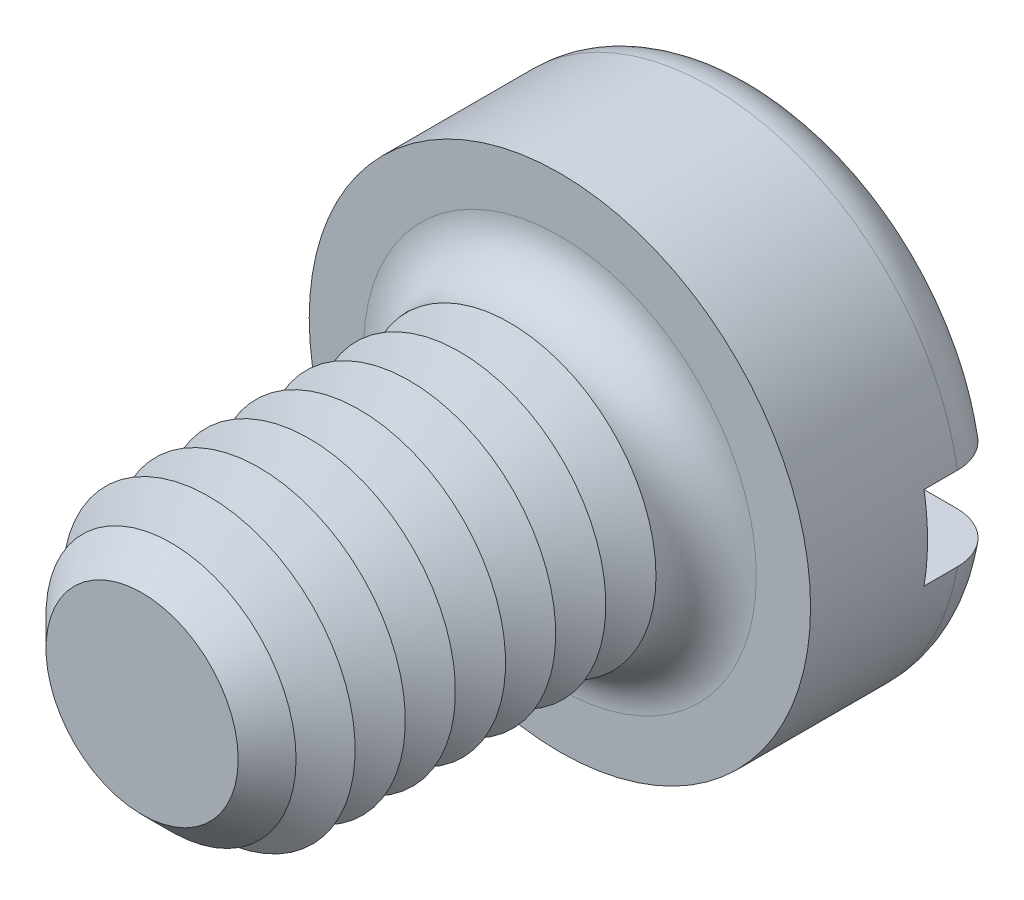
ISO-10303-21;
HEADER;
FILE_DESCRIPTION(('STEP AP214'),'2;1');
FILE_NAME('part.step','',(''),(''),'','','');
FILE_SCHEMA(('AUTOMOTIVE_DESIGN { 1 0 10303 214 1 1 1 1 }'));
ENDSEC;
DATA;
#1=APPLICATION_CONTEXT('core data for automotive mechanical design processes');
#2=APPLICATION_PROTOCOL_DEFINITION('international standard','automotive_design',2000,#1);
#3=PRODUCT_CONTEXT('',#1,'mechanical');
#4=PRODUCT('Part','Part','',(#3));
#5=PRODUCT_RELATED_PRODUCT_CATEGORY('part','',(#4));
#6=PRODUCT_DEFINITION_FORMATION('','',#4);
#7=PRODUCT_DEFINITION_CONTEXT('part definition',#1,'design');
#8=PRODUCT_DEFINITION('design','',#6,#7);
#9=PRODUCT_DEFINITION_SHAPE('','',#8);
#10=(LENGTH_UNIT() NAMED_UNIT(*) SI_UNIT(.MILLI.,.METRE.));
#11=(NAMED_UNIT(*) PLANE_ANGLE_UNIT() SI_UNIT($,.RADIAN.));
#12=(NAMED_UNIT(*) SI_UNIT($,.STERADIAN.) SOLID_ANGLE_UNIT());
#13=UNCERTAINTY_MEASURE_WITH_UNIT(LENGTH_MEASURE(1.E-05),#10,'distance_accuracy_value','');
#14=(GEOMETRIC_REPRESENTATION_CONTEXT(3) GLOBAL_UNCERTAINTY_ASSIGNED_CONTEXT((#13)) GLOBAL_UNIT_ASSIGNED_CONTEXT((#10,
#11,#12)) REPRESENTATION_CONTEXT('',''));
#15=CARTESIAN_POINT('',(0.,0.,0.));
#16=DIRECTION('',(0.,0.,1.));
#17=DIRECTION('',(1.,0.,0.));
#18=AXIS2_PLACEMENT_3D('',#15,#16,#17);
#19=CARTESIAN_POINT('',(0.,0.,-2.4));
#20=DIRECTION('',(0.,0.,1.));
#21=DIRECTION('',(1.,0.,0.));
#22=AXIS2_PLACEMENT_3D('',#19,#20,#21);
#23=PLANE('',#22);
#24=CARTESIAN_POINT('',(0.,0.,-2.4));
#25=DIRECTION('',(0.,0.,1.));
#26=DIRECTION('',(1.,0.,0.));
#27=AXIS2_PLACEMENT_3D('',#24,#25,#26);
#28=CIRCLE('',#27,2.4);
#29=CARTESIAN_POINT('',(-2.3473389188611,0.5,-2.4));
#30=VERTEX_POINT('',#29);
#31=CARTESIAN_POINT('',(2.3473389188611,0.5,-2.4));
#32=VERTEX_POINT('',#31);
#33=EDGE_CURVE('E116',#30,#32,#28,.F.);
#34=ORIENTED_EDGE('',*,*,#33,.T.);
#35=DIRECTION('',(1.,0.,0.));
#36=VECTOR('',#35,1.);
#37=CARTESIAN_POINT('',(-3.,0.5,-2.4));
#38=LINE('',#37,#36);
#39=EDGE_CURVE('E111',#30,#32,#38,.T.);
#40=ORIENTED_EDGE('',*,*,#39,.F.);
#41=EDGE_LOOP('',(#34,#40));
#42=FACE_BOUND('',#41,.T.);
#43=ADVANCED_FACE('F39',(#42),#23,.F.);
#44=CARTESIAN_POINT('',(0.,0.,-1.8));
#45=DIRECTION('',(0.,0.,1.));
#46=DIRECTION('',(1.,0.,0.));
#47=AXIS2_PLACEMENT_3D('',#44,#45,#46);
#48=TOROIDAL_SURFACE('',#47,2.4,0.6);
#49=CARTESIAN_POINT('',(-2.85761641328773,0.5,-2.13010535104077));
#50=CARTESIAN_POINT('',(-2.83871556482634,0.5,-2.1583605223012));
#51=CARTESIAN_POINT('',(-2.81738546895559,0.5,-2.18502342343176));
#52=CARTESIAN_POINT('',(-2.7705148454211,0.5,-2.23439244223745));
#53=CARTESIAN_POINT('',(-2.74496859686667,0.5,-2.25709309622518));
#54=CARTESIAN_POINT('',(-2.6904684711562,0.5,-2.29787524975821));
#55=CARTESIAN_POINT('',(-2.66151863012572,0.5,-2.3159621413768));
#56=CARTESIAN_POINT('',(-2.60103287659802,0.5,-2.34708203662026));
#57=CARTESIAN_POINT('',(-2.56949759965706,0.5,-2.36011627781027));
#58=CARTESIAN_POINT('',(-2.50430694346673,0.5,-2.38095952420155));
#59=CARTESIAN_POINT('',(-2.47062984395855,0.5,-2.38870056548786));
#60=CARTESIAN_POINT('',(-2.40245905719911,0.5,-2.39852415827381));
#61=CARTESIAN_POINT('',(-2.36796525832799,0.5,-2.40060593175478));
#62=CARTESIAN_POINT('',(-2.29850850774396,0.5,-2.39907718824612));
#63=CARTESIAN_POINT('',(-2.2635477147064,0.5,-2.3953679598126));
#64=CARTESIAN_POINT('',(-2.19472542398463,0.5,-2.38219781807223));
#65=CARTESIAN_POINT('',(-2.16086402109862,0.5,-2.37273641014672));
#66=CARTESIAN_POINT('',(-2.09483473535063,0.5,-2.3481926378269));
#67=CARTESIAN_POINT('',(-2.06268841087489,0.5,-2.3330521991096));
#68=CARTESIAN_POINT('',(-2.00140871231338,0.5,-2.29756210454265));
#69=CARTESIAN_POINT('',(-1.97227539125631,0.5,-2.27721235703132));
#70=CARTESIAN_POINT('',(-1.91805676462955,0.5,-2.23196210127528));
#71=CARTESIAN_POINT('',(-1.89294995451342,0.5,-2.20708739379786));
#72=CARTESIAN_POINT('',(-1.84740424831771,0.5,-2.1533758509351));
#73=CARTESIAN_POINT('',(-1.82696468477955,0.5,-2.12453958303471));
#74=CARTESIAN_POINT('',(-1.7919439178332,0.5,-2.06452274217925));
#75=CARTESIAN_POINT('',(-1.7772221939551,0.5,-2.03342424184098));
#76=CARTESIAN_POINT('',(-1.75343025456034,0.5,-1.96913621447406));
#77=CARTESIAN_POINT('',(-1.74435859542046,0.5,-1.93594722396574));
#78=CARTESIAN_POINT('',(-1.73243855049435,0.5,-1.86969199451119));
#79=CARTESIAN_POINT('',(-1.72938008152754,0.5,-1.83666346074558));
#80=CARTESIAN_POINT('',(-1.72896592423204,0.5,-1.77057287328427));
#81=CARTESIAN_POINT('',(-1.73160950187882,0.5,-1.73751082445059));
#82=CARTESIAN_POINT('',(-1.7423966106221,0.5,-1.67291835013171));
#83=CARTESIAN_POINT('',(-1.75043952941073,0.5,-1.64137102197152));
#84=CARTESIAN_POINT('',(-1.77163396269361,0.5,-1.58004446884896));
#85=CARTESIAN_POINT('',(-1.78478577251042,0.5,-1.55026534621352));
#86=CARTESIAN_POINT('',(-1.81598186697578,0.5,-1.49283859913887));
#87=CARTESIAN_POINT('',(-1.83409369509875,0.5,-1.46522772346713));
#88=CARTESIAN_POINT('',(-1.87455179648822,0.5,-1.41330756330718));
#89=CARTESIAN_POINT('',(-1.89689874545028,0.5,-1.38899880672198));
#90=CARTESIAN_POINT('',(-1.94600584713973,0.5,-1.34349499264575));
#91=CARTESIAN_POINT('',(-1.97289034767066,0.5,-1.32243411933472));
#92=CARTESIAN_POINT('',(-2.02972905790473,0.5,-1.28496935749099));
#93=CARTESIAN_POINT('',(-2.05968375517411,0.5,-1.26856621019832));
#94=CARTESIAN_POINT('',(-2.12276894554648,0.5,-1.24040709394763));
#95=CARTESIAN_POINT('',(-2.15596700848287,0.5,-1.22880230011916));
#96=CARTESIAN_POINT('',(-2.22383000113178,0.5,-1.21126311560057));
#97=CARTESIAN_POINT('',(-2.25849504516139,0.5,-1.20532916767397));
#98=CARTESIAN_POINT('',(-2.32870403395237,0.5,-1.1992792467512));
#99=CARTESIAN_POINT('',(-2.36425340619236,0.5,-1.19922586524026));
#100=CARTESIAN_POINT('',(-2.4348506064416,0.5,-1.2051326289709));
#101=CARTESIAN_POINT('',(-2.4698984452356,0.5,-1.21109264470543));
#102=CARTESIAN_POINT('',(-2.53821803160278,0.5,-1.22883658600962));
#103=CARTESIAN_POINT('',(-2.57150081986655,0.5,-1.24057794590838));
#104=CARTESIAN_POINT('',(-2.63557260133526,0.5,-1.2695744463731));
#105=CARTESIAN_POINT('',(-2.66636179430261,0.5,-1.28682914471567));
#106=CARTESIAN_POINT('',(-2.72402406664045,0.5,-1.32606063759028));
#107=CARTESIAN_POINT('',(-2.75095352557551,0.5,-1.34795455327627));
#108=CARTESIAN_POINT('',(-2.80067182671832,0.5,-1.39602603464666));
#109=CARTESIAN_POINT('',(-2.82346106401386,0.5,-1.42220319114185));
#110=CARTESIAN_POINT('',(-2.86383281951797,0.5,-1.47760238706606));
#111=CARTESIAN_POINT('',(-2.88149947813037,0.5,-1.50676312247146));
#112=CARTESIAN_POINT('',(-2.91160874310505,0.5,-1.56766595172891));
#113=CARTESIAN_POINT('',(-2.92405198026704,0.5,-1.59940773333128));
#114=CARTESIAN_POINT('',(-2.94319943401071,0.5,-1.66411282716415));
#115=CARTESIAN_POINT('',(-2.94997843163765,0.5,-1.69705402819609));
#116=CARTESIAN_POINT('',(-2.95787009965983,0.5,-1.7636173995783));
#117=CARTESIAN_POINT('',(-2.95898157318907,0.5,-1.79723971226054));
#118=CARTESIAN_POINT('',(-2.95551354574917,0.5,-1.86397776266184));
#119=CARTESIAN_POINT('',(-2.95096897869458,0.5,-1.89709534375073));
#120=CARTESIAN_POINT('',(-2.93638731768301,0.5,-1.96206785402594));
#121=CARTESIAN_POINT('',(-2.92635713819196,0.5,-1.99392431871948));
#122=CARTESIAN_POINT('',(-2.90618743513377,0.5,-2.04315073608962));
#123=CARTESIAN_POINT('',(-2.89769874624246,0.5,-2.06121519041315));
#124=CARTESIAN_POINT('',(-2.87895753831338,0.5,-2.096404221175));
#125=CARTESIAN_POINT('',(-2.86870503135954,0.5,-2.11352880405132));
#126=CARTESIAN_POINT('',(-2.85761641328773,0.5,-2.13010535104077));
#127=B_SPLINE_CURVE_WITH_KNOTS('',3,(#49,#50,#51,#52,#53,#54,#55,#56,#57,#58,#59,#60,#61,#62,
#63,#64,#65,#66,#67,#68,#69,#70,#71,#72,#73,#74,#75,#76,#77,#78,#79,#80,#81,#82,#83,#84,#85,#86,
#87,#88,#89,#90,#91,#92,#93,#94,#95,#96,#97,#98,#99,#100,#101,#102,#103,#104,#105,#106,#107,
#108,#109,#110,#111,#112,#113,#114,#115,#116,#117,#118,#119,#120,#121,#122,#123,#124,#125,#126),
.UNSPECIFIED.,.T.,.F.,(4,2,2,2,2,2,2,2,2,2,2,2,2,2,2,2,2,2,2,2,2,2,2,2,2,2,2,2,2,2,2,2,2,2,2,2,
2,2,4),(0.,0.101907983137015,0.203955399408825,0.305883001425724,0.407785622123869,
0.510973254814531,0.614175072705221,0.719155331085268,0.824144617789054,0.930238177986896,
1.03633360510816,1.14184204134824,1.24733537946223,1.35004136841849,1.45272110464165,
1.5517448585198,1.65075586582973,1.74797128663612,1.84519232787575,1.9438094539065,
2.0424423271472,2.14443321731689,2.24644032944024,2.35145317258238,2.45647421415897,
2.56261297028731,2.66874944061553,2.77411589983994,2.87947390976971,2.98308820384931,
3.08669260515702,3.18848388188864,3.29026286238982,3.39067588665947,3.49111011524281,
3.59092708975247,3.69061853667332,3.75040561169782,3.81019227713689),.UNSPECIFIED.);
#128=CARTESIAN_POINT('',(-2.95803989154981,0.5,-1.8));
#129=VERTEX_POINT('',#128);
#130=EDGE_CURVE('E241',#129,#30,#127,.T.);
#131=ORIENTED_EDGE('',*,*,#130,.F.);
#132=CARTESIAN_POINT('',(0.,0.,-1.8));
#133=DIRECTION('',(0.,0.,1.));
#134=DIRECTION('',(1.,0.,0.));
#135=AXIS2_PLACEMENT_3D('',#132,#133,#134);
#136=CIRCLE('',#135,3.);
#137=CARTESIAN_POINT('',(2.95803989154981,0.5,-1.8));
#138=VERTEX_POINT('',#137);
#139=EDGE_CURVE('E125',#138,#129,#136,.T.);
#140=ORIENTED_EDGE('',*,*,#139,.F.);
#141=CARTESIAN_POINT('',(1.78664846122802,0.5,-2.05158390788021));
#142=CARTESIAN_POINT('',(1.80142751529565,0.5,-2.08239430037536));
#143=CARTESIAN_POINT('',(1.81889355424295,0.5,-2.111949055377));
#144=CARTESIAN_POINT('',(1.8585933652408,0.5,-2.16770384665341));
#145=CARTESIAN_POINT('',(1.88083491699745,0.5,-2.19389829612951));
#146=CARTESIAN_POINT('',(1.92931942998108,0.5,-2.24217519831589));
#147=CARTESIAN_POINT('',(1.95555471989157,0.5,-2.26426535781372));
#148=CARTESIAN_POINT('',(2.01127789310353,0.5,-2.30384045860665));
#149=CARTESIAN_POINT('',(2.04076488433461,0.5,-2.32132665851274));
#150=CARTESIAN_POINT('',(2.10290022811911,0.5,-2.3516259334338));
#151=CARTESIAN_POINT('',(2.13560600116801,0.5,-2.3643213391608));
#152=CARTESIAN_POINT('',(2.20267136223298,0.5,-2.38412242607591));
#153=CARTESIAN_POINT('',(2.23703118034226,0.5,-2.3912273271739));
#154=CARTESIAN_POINT('',(2.30690186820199,0.5,-2.39969404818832));
#155=CARTESIAN_POINT('',(2.34242185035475,0.5,-2.40098100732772));
#156=CARTESIAN_POINT('',(2.41317063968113,0.5,-2.39753827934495));
#157=CARTESIAN_POINT('',(2.44839945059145,0.5,-2.39280866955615));
#158=CARTESIAN_POINT('',(2.51734146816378,0.5,-2.37746773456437));
#159=CARTESIAN_POINT('',(2.55106223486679,0.5,-2.3668904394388));
#160=CARTESIAN_POINT('',(2.61620389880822,0.5,-2.34013333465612));
#161=CARTESIAN_POINT('',(2.64762498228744,0.5,-2.32395397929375));
#162=CARTESIAN_POINT('',(2.70673284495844,0.5,-2.28672393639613));
#163=CARTESIAN_POINT('',(2.73447138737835,0.5,-2.26575544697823));
#164=CARTESIAN_POINT('',(2.78595339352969,0.5,-2.21938197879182));
#165=CARTESIAN_POINT('',(2.80969724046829,0.5,-2.19397742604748));
#166=CARTESIAN_POINT('',(2.85207235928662,0.5,-2.13993965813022));
#167=CARTESIAN_POINT('',(2.87078674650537,0.5,-2.11137160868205));
#168=CARTESIAN_POINT('',(2.90307455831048,0.5,-2.05146448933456));
#169=CARTESIAN_POINT('',(2.91664841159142,0.5,-2.02012565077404));
#170=CARTESIAN_POINT('',(2.93808283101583,0.5,-1.95603682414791));
#171=CARTESIAN_POINT('',(2.94602016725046,0.5,-1.92331249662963));
#172=CARTESIAN_POINT('',(2.95624273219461,0.5,-1.85699296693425));
#173=CARTESIAN_POINT('',(2.95852824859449,0.5,-1.82339780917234));
#174=CARTESIAN_POINT('',(2.95738171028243,0.5,-1.75655451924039));
#175=CARTESIAN_POINT('',(2.95399174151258,0.5,-1.72330565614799));
#176=CARTESIAN_POINT('',(2.94167749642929,0.5,-1.65784996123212));
#177=CARTESIAN_POINT('',(2.93275329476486,0.5,-1.62564311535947));
#178=CARTESIAN_POINT('',(2.90963870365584,0.5,-1.56317641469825));
#179=CARTESIAN_POINT('',(2.89544787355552,0.5,-1.53291672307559));
#180=CARTESIAN_POINT('',(2.86222325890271,0.5,-1.47518589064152));
#181=CARTESIAN_POINT('',(2.84318935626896,0.5,-1.44771481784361));
#182=CARTESIAN_POINT('',(2.80067851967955,0.5,-1.39611362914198));
#183=CARTESIAN_POINT('',(2.77716960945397,0.5,-1.37200986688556));
#184=CARTESIAN_POINT('',(2.72648704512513,0.5,-1.3280274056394));
#185=CARTESIAN_POINT('',(2.69931317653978,0.5,-1.3081489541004));
#186=CARTESIAN_POINT('',(2.64167967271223,0.5,-1.27288334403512));
#187=CARTESIAN_POINT('',(2.61118015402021,0.5,-1.25756138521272));
#188=CARTESIAN_POINT('',(2.54807315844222,0.5,-1.2321564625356));
#189=CARTESIAN_POINT('',(2.51546550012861,0.5,-1.22207395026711));
#190=CARTESIAN_POINT('',(2.44846246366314,0.5,-1.20724783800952));
#191=CARTESIAN_POINT('',(2.41404584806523,0.5,-1.2026002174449));
#192=CARTESIAN_POINT('',(2.34491756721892,0.5,-1.19904907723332));
#193=CARTESIAN_POINT('',(2.3102058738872,0.5,-1.20014611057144));
#194=CARTESIAN_POINT('',(2.24087507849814,0.5,-1.20808958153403));
#195=CARTESIAN_POINT('',(2.20626660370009,0.5,-1.21502895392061));
#196=CARTESIAN_POINT('',(2.13868705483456,0.5,-1.23457616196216));
#197=CARTESIAN_POINT('',(2.10571611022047,0.5,-1.24718444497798));
#198=CARTESIAN_POINT('',(2.04212010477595,0.5,-1.2778419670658));
#199=CARTESIAN_POINT('',(2.0115131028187,0.5,-1.29592871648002));
#200=CARTESIAN_POINT('',(1.95381117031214,0.5,-1.33703838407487));
#201=CARTESIAN_POINT('',(1.92671618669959,0.5,-1.36006122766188));
#202=CARTESIAN_POINT('',(1.8771749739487,0.5,-1.41014760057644));
#203=CARTESIAN_POINT('',(1.85467966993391,0.5,-1.43716252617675));
#204=CARTESIAN_POINT('',(1.8147167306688,0.5,-1.49468601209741));
#205=CARTESIAN_POINT('',(1.79724791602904,0.5,-1.52519375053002));
#206=CARTESIAN_POINT('',(1.76843420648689,0.5,-1.58782676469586));
#207=CARTESIAN_POINT('',(1.75691546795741,0.5,-1.61987202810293));
#208=CARTESIAN_POINT('',(1.73963101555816,0.5,-1.68548715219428));
#209=CARTESIAN_POINT('',(1.73386545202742,0.5,-1.71905705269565));
#210=CARTESIAN_POINT('',(1.72840927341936,0.5,-1.78556262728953));
#211=CARTESIAN_POINT('',(1.72852416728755,0.5,-1.8184825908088));
#212=CARTESIAN_POINT('',(1.73434422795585,0.5,-1.88379362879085));
#213=CARTESIAN_POINT('',(1.74004181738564,0.5,-1.91618535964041));
#214=CARTESIAN_POINT('',(1.75312909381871,0.5,-1.96568884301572));
#215=CARTESIAN_POINT('',(1.75869685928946,0.5,-1.98330302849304));
#216=CARTESIAN_POINT('',(1.77146455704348,0.5,-2.01792824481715));
#217=CARTESIAN_POINT('',(1.7786644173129,0.5,-2.03493930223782));
#218=CARTESIAN_POINT('',(1.78664846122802,0.5,-2.05158390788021));
#219=B_SPLINE_CURVE_WITH_KNOTS('',3,(#141,#142,#143,#144,#145,#146,#147,#148,#149,#150,#151,
#152,#153,#154,#155,#156,#157,#158,#159,#160,#161,#162,#163,#164,#165,#166,#167,#168,#169,#170,
#171,#172,#173,#174,#175,#176,#177,#178,#179,#180,#181,#182,#183,#184,#185,#186,#187,#188,#189,
#190,#191,#192,#193,#194,#195,#196,#197,#198,#199,#200,#201,#202,#203,#204,#205,#206,#207,#208,
#209,#210,#211,#212,#213,#214,#215,#216,#217,#218),.UNSPECIFIED.,.T.,.F.,(4,2,2,2,2,2,2,2,2,2,2,
2,2,2,2,2,2,2,2,2,2,2,2,2,2,2,2,2,2,2,2,2,2,2,2,2,2,2,4),(0.,0.10244464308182,0.205057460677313,
0.307475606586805,0.409865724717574,0.514628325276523,0.619405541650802,0.72552718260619,
0.831647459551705,0.937156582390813,1.04265715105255,1.1464674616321,1.25026780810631,
1.3522293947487,1.45418247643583,1.55471883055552,1.6552500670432,1.75503912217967,
1.8548268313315,1.95462289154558,2.05442138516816,2.15496174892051,2.25550799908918,
2.35743049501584,2.45936177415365,2.56306719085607,2.66678259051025,2.77217967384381,
2.87758507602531,2.98372914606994,3.08987161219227,3.19481457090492,3.29973288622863,
3.40138228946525,3.50303434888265,3.60132659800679,3.69948562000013,3.75483142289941,
3.8101747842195),.UNSPECIFIED.);
#220=EDGE_CURVE('E243',#32,#138,#219,.T.);
#221=ORIENTED_EDGE('',*,*,#220,.F.);
#222=ORIENTED_EDGE('',*,*,#33,.F.);
#223=EDGE_LOOP('',(#131,#140,#221,#222));
#224=FACE_BOUND('',#223,.T.);
#225=ADVANCED_FACE('F225',(#224),#48,.T.);
#226=CARTESIAN_POINT('',(0.,0.,-2.4));
#227=DIRECTION('',(0.,0.,1.));
#228=DIRECTION('',(1.,0.,0.));
#229=AXIS2_PLACEMENT_3D('',#226,#227,#228);
#230=CYLINDRICAL_SURFACE('',#229,3.);
#231=DIRECTION('',(0.,0.,1.));
#232=VECTOR('',#231,1.);
#233=CARTESIAN_POINT('',(2.95803989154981,0.5,-2.4));
#234=LINE('',#233,#232);
#235=CARTESIAN_POINT('',(2.95803989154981,0.5,-1.4));
#236=VERTEX_POINT('',#235);
#237=EDGE_CURVE('E257',#138,#236,#234,.T.);
#238=ORIENTED_EDGE('',*,*,#237,.F.);
#239=ORIENTED_EDGE('',*,*,#139,.T.);
#240=DIRECTION('',(0.,0.,1.));
#241=VECTOR('',#240,1.);
#242=CARTESIAN_POINT('',(-2.95803989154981,0.5,-2.4));
#243=LINE('',#242,#241);
#244=CARTESIAN_POINT('',(-2.95803989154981,0.5,-1.4));
#245=VERTEX_POINT('',#244);
#246=EDGE_CURVE('E63',#245,#129,#243,.F.);
#247=ORIENTED_EDGE('',*,*,#246,.F.);
#248=CARTESIAN_POINT('',(0.,0.,-1.4));
#249=DIRECTION('',(0.,0.,-1.));
#250=DIRECTION('',(-1.,0.,0.));
#251=AXIS2_PLACEMENT_3D('',#248,#249,#250);
#252=CIRCLE('',#251,3.);
#253=CARTESIAN_POINT('',(-2.95803989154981,-0.5,-1.4));
#254=VERTEX_POINT('',#253);
#255=EDGE_CURVE('E43',#245,#254,#252,.F.);
#256=ORIENTED_EDGE('',*,*,#255,.T.);
#257=DIRECTION('',(0.,0.,1.));
#258=VECTOR('',#257,1.);
#259=CARTESIAN_POINT('',(-2.95803989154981,-0.5,-2.4));
#260=LINE('',#259,#258);
#261=CARTESIAN_POINT('',(-2.9580398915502,-0.5,-1.79999999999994));
#262=VERTEX_POINT('',#261);
#263=EDGE_CURVE('E255',#262,#254,#260,.T.);
#264=ORIENTED_EDGE('',*,*,#263,.F.);
#265=CARTESIAN_POINT('',(2.95803989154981,-0.5,-1.8));
#266=VERTEX_POINT('',#265);
#267=EDGE_CURVE('E127',#262,#266,#136,.T.);
#268=ORIENTED_EDGE('',*,*,#267,.T.);
#269=DIRECTION('',(0.,0.,1.));
#270=VECTOR('',#269,1.);
#271=CARTESIAN_POINT('',(2.95803989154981,-0.5,-2.4));
#272=LINE('',#271,#270);
#273=CARTESIAN_POINT('',(2.95803989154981,-0.5,-1.4));
#274=VERTEX_POINT('',#273);
#275=EDGE_CURVE('E55',#274,#266,#272,.F.);
#276=ORIENTED_EDGE('',*,*,#275,.F.);
#277=EDGE_CURVE('E11',#274,#236,#252,.F.);
#278=ORIENTED_EDGE('',*,*,#277,.T.);
#279=EDGE_LOOP('',(#238,#239,#247,#256,#264,#268,#276,#278));
#280=FACE_BOUND('',#279,.T.);
#281=CARTESIAN_POINT('',(0.,0.,0.));
#282=DIRECTION('',(0.,0.,1.));
#283=DIRECTION('',(1.,0.,0.));
#284=AXIS2_PLACEMENT_3D('',#281,#282,#283);
#285=CIRCLE('',#284,3.);
#286=CARTESIAN_POINT('',(3.,0.,0.));
#287=VERTEX_POINT('',#286);
#288=EDGE_CURVE('E260',#287,#287,#285,.T.);
#289=ORIENTED_EDGE('',*,*,#288,.F.);
#290=EDGE_LOOP('',(#289));
#291=FACE_BOUND('',#290,.T.);
#292=ADVANCED_FACE('F221',(#280,#291),#230,.T.);
#293=CARTESIAN_POINT('',(2.3473389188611,-0.5,-2.4));
#294=VERTEX_POINT('',#293);
#295=CARTESIAN_POINT('',(-2.3473389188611,-0.5,-2.4));
#296=VERTEX_POINT('',#295);
#297=EDGE_CURVE('E109',#294,#296,#28,.F.);
#298=ORIENTED_EDGE('',*,*,#297,.T.);
#299=DIRECTION('',(-1.,0.,0.));
#300=VECTOR('',#299,1.);
#301=CARTESIAN_POINT('',(-3.,-0.5,-2.4));
#302=LINE('',#301,#300);
#303=EDGE_CURVE('E96',#294,#296,#302,.T.);
#304=ORIENTED_EDGE('',*,*,#303,.F.);
#305=EDGE_LOOP('',(#298,#304));
#306=FACE_BOUND('',#305,.T.);
#307=ADVANCED_FACE('F108',(#306),#23,.F.);
#308=CARTESIAN_POINT('',(0.,0.,0.));
#309=DIRECTION('',(0.,0.,1.));
#310=DIRECTION('',(1.,0.,0.));
#311=AXIS2_PLACEMENT_3D('',#308,#309,#310);
#312=PLANE('',#311);
#313=CARTESIAN_POINT('',(0.,0.,0.));
#314=DIRECTION('',(0.,0.,1.));
#315=DIRECTION('',(1.,0.,0.));
#316=AXIS2_PLACEMENT_3D('',#313,#314,#315);
#317=CIRCLE('',#316,2.35);
#318=CARTESIAN_POINT('',(2.35,0.,0.));
#319=VERTEX_POINT('',#318);
#320=EDGE_CURVE('E115',#319,#319,#317,.F.);
#321=ORIENTED_EDGE('',*,*,#320,.T.);
#322=EDGE_LOOP('',(#321));
#323=FACE_BOUND('',#322,.T.);
#324=ORIENTED_EDGE('',*,*,#288,.T.);
#325=EDGE_LOOP('',(#324));
#326=FACE_BOUND('',#325,.T.);
#327=ADVANCED_FACE('F220',(#323,#326),#312,.T.);
#328=CARTESIAN_POINT('',(-2.85761641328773,-0.5,-2.13010535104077));
#329=CARTESIAN_POINT('',(-2.87617085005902,-0.5,-2.10236255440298));
#330=CARTESIAN_POINT('',(-2.89241094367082,-0.5,-2.07304478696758));
#331=CARTESIAN_POINT('',(-2.91975805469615,-0.5,-2.01207835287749));
#332=CARTESIAN_POINT('',(-2.93085958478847,-0.5,-1.98042723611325));
#333=CARTESIAN_POINT('',(-2.94757590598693,-0.5,-1.91570997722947));
#334=CARTESIAN_POINT('',(-2.95319165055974,-0.5,-1.88264408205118));
#335=CARTESIAN_POINT('',(-2.95876526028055,-0.5,-1.81604673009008));
#336=CARTESIAN_POINT('',(-2.95872441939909,-0.5,-1.78251538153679));
#337=CARTESIAN_POINT('',(-2.95300126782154,-0.5,-1.71606888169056));
#338=CARTESIAN_POINT('',(-2.94734076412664,-0.5,-1.68315184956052));
#339=CARTESIAN_POINT('',(-2.93058183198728,-0.5,-1.61873244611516));
#340=CARTESIAN_POINT('',(-2.91948325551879,-0.5,-1.58723011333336));
#341=CARTESIAN_POINT('',(-2.89215903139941,-0.5,-1.52647404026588));
#342=CARTESIAN_POINT('',(-2.87592518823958,-0.5,-1.49722398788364));
#343=CARTESIAN_POINT('',(-2.83881787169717,-0.5,-1.44183365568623));
#344=CARTESIAN_POINT('',(-2.81794425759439,-0.5,-1.41569347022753));
#345=CARTESIAN_POINT('',(-2.77196258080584,-0.5,-1.36700890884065));
#346=CARTESIAN_POINT('',(-2.74681874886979,-0.5,-1.34449832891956));
#347=CARTESIAN_POINT('',(-2.69315595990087,-0.5,-1.30394571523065));
#348=CARTESIAN_POINT('',(-2.66463678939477,-0.5,-1.28590396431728));
#349=CARTESIAN_POINT('',(-2.6045885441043,-0.5,-1.25451133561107));
#350=CARTESIAN_POINT('',(-2.573021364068,-0.5,-1.24123336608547));
#351=CARTESIAN_POINT('',(-2.50813094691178,-0.5,-1.22006271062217));
#352=CARTESIAN_POINT('',(-2.47480755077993,-0.5,-1.21217051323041));
#353=CARTESIAN_POINT('',(-2.40672281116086,-0.5,-1.20185046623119));
#354=CARTESIAN_POINT('',(-2.37194646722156,-0.5,-1.19952155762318));
#355=CARTESIAN_POINT('',(-2.30248663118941,-0.5,-1.20064178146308));
#356=CARTESIAN_POINT('',(-2.26780314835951,-0.5,-1.20409147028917));
#357=CARTESIAN_POINT('',(-2.19896003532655,-0.5,-1.21674803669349));
#358=CARTESIAN_POINT('',(-2.16481620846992,-0.5,-1.22604100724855));
#359=CARTESIAN_POINT('',(-2.09855902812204,-0.5,-1.25020237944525));
#360=CARTESIAN_POINT('',(-2.0664458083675,-0.5,-1.2650711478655));
#361=CARTESIAN_POINT('',(-2.00504979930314,-0.5,-1.3000633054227));
#362=CARTESIAN_POINT('',(-1.97577870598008,-0.5,-1.32020724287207));
#363=CARTESIAN_POINT('',(-1.92109882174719,-0.5,-1.36519538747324));
#364=CARTESIAN_POINT('',(-1.89568984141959,-0.5,-1.39003936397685));
#365=CARTESIAN_POINT('',(-1.84992350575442,-0.5,-1.44333696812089));
#366=CARTESIAN_POINT('',(-1.82949305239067,-0.5,-1.47172774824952));
#367=CARTESIAN_POINT('',(-1.79388305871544,-0.5,-1.53163225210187));
#368=CARTESIAN_POINT('',(-1.77870235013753,-0.5,-1.56314527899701));
#369=CARTESIAN_POINT('',(-1.7545759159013,-0.5,-1.62726698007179));
#370=CARTESIAN_POINT('',(-1.74543784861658,-0.5,-1.65980327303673));
#371=CARTESIAN_POINT('',(-1.73294830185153,-0.5,-1.72596654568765));
#372=CARTESIAN_POINT('',(-1.72959555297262,-0.5,-1.7595932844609));
#373=CARTESIAN_POINT('',(-1.72881879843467,-0.5,-1.82588200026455));
#374=CARTESIAN_POINT('',(-1.73121660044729,-0.5,-1.85854202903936));
#375=CARTESIAN_POINT('',(-1.74148022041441,-0.5,-1.9229888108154));
#376=CARTESIAN_POINT('',(-1.74934586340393,-0.5,-1.95477559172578));
#377=CARTESIAN_POINT('',(-1.77023164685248,-0.5,-2.01650910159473));
#378=CARTESIAN_POINT('',(-1.78323812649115,-0.5,-2.04646046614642));
#379=CARTESIAN_POINT('',(-1.81396733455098,-0.5,-2.10383471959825));
#380=CARTESIAN_POINT('',(-1.83169061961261,-0.5,-2.13125730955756));
#381=CARTESIAN_POINT('',(-1.87183626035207,-0.5,-2.18359240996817));
#382=CARTESIAN_POINT('',(-1.89437158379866,-0.5,-2.20841820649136));
#383=CARTESIAN_POINT('',(-1.9431646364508,-0.5,-2.25409214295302));
#384=CARTESIAN_POINT('',(-1.96942301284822,-0.5,-2.27493958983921));
#385=CARTESIAN_POINT('',(-2.025898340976,-0.5,-2.31281042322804));
#386=CARTESIAN_POINT('',(-2.05622082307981,-0.5,-2.32967654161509));
#387=CARTESIAN_POINT('',(-2.11922391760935,-0.5,-2.35820255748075));
#388=CARTESIAN_POINT('',(-2.15190483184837,-0.5,-2.3698617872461));
#389=CARTESIAN_POINT('',(-2.21944675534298,-0.5,-2.38785911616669));
#390=CARTESIAN_POINT('',(-2.25433929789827,-0.5,-2.39407914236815));
#391=CARTESIAN_POINT('',(-2.32467357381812,-0.5,-2.40058243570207));
#392=CARTESIAN_POINT('',(-2.36011530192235,-0.5,-2.40086575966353));
#393=CARTESIAN_POINT('',(-2.43058129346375,-0.5,-2.39545061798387));
#394=CARTESIAN_POINT('',(-2.46560504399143,-0.5,-2.38974544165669));
#395=CARTESIAN_POINT('',(-2.53418188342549,-0.5,-2.37245602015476));
#396=CARTESIAN_POINT('',(-2.56773468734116,-0.5,-2.36087064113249));
#397=CARTESIAN_POINT('',(-2.63195003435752,-0.5,-2.33229154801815));
#398=CARTESIAN_POINT('',(-2.66264330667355,-0.5,-2.31536681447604));
#399=CARTESIAN_POINT('',(-2.72065333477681,-0.5,-2.2765252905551));
#400=CARTESIAN_POINT('',(-2.7479744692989,-0.5,-2.25461508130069));
#401=CARTESIAN_POINT('',(-2.78903570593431,-0.5,-2.21539504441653));
#402=CARTESIAN_POINT('',(-2.80405150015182,-0.5,-2.19939833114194));
#403=CARTESIAN_POINT('',(-2.83224965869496,-0.5,-2.16586257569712));
#404=CARTESIAN_POINT('',(-2.84543204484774,-0.5,-2.14832355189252));
#405=CARTESIAN_POINT('',(-2.85761641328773,-0.5,-2.13010535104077));
#406=B_SPLINE_CURVE_WITH_KNOTS('',3,(#328,#329,#330,#331,#332,#333,#334,#335,#336,#337,#338,
#339,#340,#341,#342,#343,#344,#345,#346,#347,#348,#349,#350,#351,#352,#353,#354,#355,#356,#357,
#358,#359,#360,#361,#362,#363,#364,#365,#366,#367,#368,#369,#370,#371,#372,#373,#374,#375,#376,
#377,#378,#379,#380,#381,#382,#383,#384,#385,#386,#387,#388,#389,#390,#391,#392,#393,#394,#395,
#396,#397,#398,#399,#400,#401,#402,#403,#404,#405),.UNSPECIFIED.,.T.,.F.,(4,2,2,2,2,2,2,2,2,2,2,
2,2,2,2,2,2,2,2,2,2,2,2,2,2,2,2,2,2,2,2,2,2,2,2,2,2,2,4),(0.,0.100047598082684,
0.200201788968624,0.300338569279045,0.400452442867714,0.500179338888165,0.599908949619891,
0.699798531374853,0.799691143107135,0.900465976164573,1.00124718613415,1.10351091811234,
1.20578392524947,1.30986270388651,1.41395150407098,1.51961105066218,1.62527754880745,
1.73136193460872,1.83744111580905,1.94185359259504,2.04624281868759,2.1471248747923,
2.24798479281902,2.34575994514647,2.44353196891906,2.541045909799,2.63857136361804,
2.73870431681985,2.83885469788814,2.94247024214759,3.0460990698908,3.15192527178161,
3.25775046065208,3.36369436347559,3.46965870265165,3.57430655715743,3.67881706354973,
3.74451732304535,3.81021680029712),.UNSPECIFIED.);
#407=EDGE_CURVE('E103',#296,#262,#406,.T.);
#408=ORIENTED_EDGE('',*,*,#407,.F.);
#409=ORIENTED_EDGE('',*,*,#297,.F.);
#410=CARTESIAN_POINT('',(1.78664846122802,-0.5,-2.05158390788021));
#411=CARTESIAN_POINT('',(1.77253256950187,-0.5,-2.02214917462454));
#412=CARTESIAN_POINT('',(1.76084795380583,-0.5,-1.99152692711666));
#413=CARTESIAN_POINT('',(1.74276267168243,-0.5,-1.92873811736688));
#414=CARTESIAN_POINT('',(1.73636622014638,-0.5,-1.89657034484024));
#415=CARTESIAN_POINT('',(1.72910271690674,-0.5,-1.83160458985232));
#416=CARTESIAN_POINT('',(1.72823699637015,-0.5,-1.79880645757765));
#417=CARTESIAN_POINT('',(1.73207277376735,-0.5,-1.73354460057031));
#418=CARTESIAN_POINT('',(1.7367732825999,-0.5,-1.70108081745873));
#419=CARTESIAN_POINT('',(1.75151033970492,-0.5,-1.63763571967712));
#420=CARTESIAN_POINT('',(1.76150868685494,-0.5,-1.60664550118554));
#421=CARTESIAN_POINT('',(1.78646773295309,-0.5,-1.54673433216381));
#422=CARTESIAN_POINT('',(1.80142897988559,-0.5,-1.51781361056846));
#423=CARTESIAN_POINT('',(1.8361687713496,-0.5,-1.46223275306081));
#424=CARTESIAN_POINT('',(1.85603637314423,-0.5,-1.43562834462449));
#425=CARTESIAN_POINT('',(1.89981598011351,-0.5,-1.38598822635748));
#426=CARTESIAN_POINT('',(1.92372865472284,-0.5,-1.3629531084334));
#427=CARTESIAN_POINT('',(1.97581791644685,-0.5,-1.32025912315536));
#428=CARTESIAN_POINT('',(2.00411431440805,-0.5,-1.30074638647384));
#429=CARTESIAN_POINT('',(2.06351340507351,-0.5,-1.26660223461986));
#430=CARTESIAN_POINT('',(2.09461651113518,-0.5,-1.2519715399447));
#431=CARTESIAN_POINT('',(2.15964055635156,-0.5,-1.22763649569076));
#432=CARTESIAN_POINT('',(2.19361437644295,-0.5,-1.21807321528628));
#433=CARTESIAN_POINT('',(2.26268197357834,-0.5,-1.20474094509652));
#434=CARTESIAN_POINT('',(2.29777581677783,-0.5,-1.20097229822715));
#435=CARTESIAN_POINT('',(2.36834397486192,-0.5,-1.19935270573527));
#436=CARTESIAN_POINT('',(2.40381924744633,-0.5,-1.20154258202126));
#437=CARTESIAN_POINT('',(2.47388621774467,-0.5,-1.211906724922));
#438=CARTESIAN_POINT('',(2.50847794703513,-0.5,-1.22008077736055));
#439=CARTESIAN_POINT('',(2.57542869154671,-0.5,-1.24211740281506));
#440=CARTESIAN_POINT('',(2.60780612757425,-0.5,-1.25592395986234));
#441=CARTESIAN_POINT('',(2.66972487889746,-0.5,-1.28886991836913));
#442=CARTESIAN_POINT('',(2.69926644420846,-0.5,-1.3080088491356));
#443=CARTESIAN_POINT('',(2.75412764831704,-0.5,-1.35072337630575));
#444=CARTESIAN_POINT('',(2.77951140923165,-0.5,-1.37421661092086));
#445=CARTESIAN_POINT('',(2.82588981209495,-0.5,-1.42519687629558));
#446=CARTESIAN_POINT('',(2.84688487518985,-0.5,-1.4526835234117));
#447=CARTESIAN_POINT('',(2.88351678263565,-0.5,-1.51036368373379));
#448=CARTESIAN_POINT('',(2.89923879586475,-0.5,-1.54050312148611));
#449=CARTESIAN_POINT('',(2.92532780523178,-0.5,-1.60301687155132));
#450=CARTESIAN_POINT('',(2.93569520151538,-0.5,-1.63539101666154));
#451=CARTESIAN_POINT('',(2.95066155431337,-0.5,-1.70102985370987));
#452=CARTESIAN_POINT('',(2.95532930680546,-0.5,-1.73427887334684));
#453=CARTESIAN_POINT('',(2.9589838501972,-0.5,-1.80108716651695));
#454=CARTESIAN_POINT('',(2.95797087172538,-0.5,-1.83464642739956));
#455=CARTESIAN_POINT('',(2.9503157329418,-0.5,-1.90093629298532));
#456=CARTESIAN_POINT('',(2.9437032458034,-0.5,-1.93367033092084));
#457=CARTESIAN_POINT('',(2.92508830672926,-0.5,-1.99756717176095));
#458=CARTESIAN_POINT('',(2.91308586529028,-0.5,-2.02872997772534));
#459=CARTESIAN_POINT('',(2.88401713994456,-0.5,-2.08868263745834));
#460=CARTESIAN_POINT('',(2.86693946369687,-0.5,-2.11746696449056));
#461=CARTESIAN_POINT('',(2.82823635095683,-0.5,-2.17179415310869));
#462=CARTESIAN_POINT('',(2.80661076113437,-0.5,-2.19733690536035));
#463=CARTESIAN_POINT('',(2.75921750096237,-0.5,-2.24472182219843));
#464=CARTESIAN_POINT('',(2.73341278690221,-0.5,-2.26652692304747));
#465=CARTESIAN_POINT('',(2.67855512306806,-0.5,-2.30557116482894));
#466=CARTESIAN_POINT('',(2.64950194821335,-0.5,-2.32280998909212));
#467=CARTESIAN_POINT('',(2.58850670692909,-0.5,-2.35251615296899));
#468=CARTESIAN_POINT('',(2.55652763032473,-0.5,-2.36490748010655));
#469=CARTESIAN_POINT('',(2.4909651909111,-0.5,-2.38424946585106));
#470=CARTESIAN_POINT('',(2.45738167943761,-0.5,-2.39119961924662));
#471=CARTESIAN_POINT('',(2.38892891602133,-0.5,-2.39958830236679));
#472=CARTESIAN_POINT('',(2.35404742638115,-0.5,-2.40092701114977));
#473=CARTESIAN_POINT('',(2.28454389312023,-0.5,-2.39781917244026));
#474=CARTESIAN_POINT('',(2.24992186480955,-0.5,-2.39337228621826));
#475=CARTESIAN_POINT('',(2.18139250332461,-0.5,-2.37872879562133));
#476=CARTESIAN_POINT('',(2.14750264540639,-0.5,-2.36845030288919));
#477=CARTESIAN_POINT('',(2.08190943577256,-0.5,-2.34236291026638));
#478=CARTESIAN_POINT('',(2.05020675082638,-0.5,-2.32655233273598));
#479=CARTESIAN_POINT('',(1.98982495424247,-0.5,-2.28976285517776));
#480=CARTESIAN_POINT('',(1.96115527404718,-0.5,-2.26876847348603));
#481=CARTESIAN_POINT('',(1.90785147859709,-0.5,-2.22220002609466));
#482=CARTESIAN_POINT('',(1.88321231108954,-0.5,-2.19663177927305));
#483=CARTESIAN_POINT('',(1.84638483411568,-0.5,-2.15106161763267));
#484=CARTESIAN_POINT('',(1.8328227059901,-0.5,-2.13215328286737));
#485=CARTESIAN_POINT('',(1.80797918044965,-0.5,-2.09289185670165));
#486=CARTESIAN_POINT('',(1.79669771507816,-0.5,-2.07253880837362));
#487=CARTESIAN_POINT('',(1.78664846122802,-0.5,-2.05158390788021));
#488=B_SPLINE_CURVE_WITH_KNOTS('',3,(#410,#411,#412,#413,#414,#415,#416,#417,#418,#419,#420,
#421,#422,#423,#424,#425,#426,#427,#428,#429,#430,#431,#432,#433,#434,#435,#436,#437,#438,#439,
#440,#441,#442,#443,#444,#445,#446,#447,#448,#449,#450,#451,#452,#453,#454,#455,#456,#457,#458,
#459,#460,#461,#462,#463,#464,#465,#466,#467,#468,#469,#470,#471,#472,#473,#474,#475,#476,#477,
#478,#479,#480,#481,#482,#483,#484,#485,#486,#487),.UNSPECIFIED.,.T.,.F.,(4,2,2,2,2,2,2,2,2,2,2,
2,2,2,2,2,2,2,2,2,2,2,2,2,2,2,2,2,2,2,2,2,2,2,2,2,2,2,4),(0.,0.0978512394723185,0.19578039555,
0.293733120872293,0.391668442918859,0.488907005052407,0.58615630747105,0.685320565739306,
0.784501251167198,0.887148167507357,0.989810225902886,1.09519726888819,1.20059054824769,
1.30670769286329,1.41282103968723,1.51790384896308,1.62297738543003,1.72623563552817,
1.82948397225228,1.93097382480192,2.03245609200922,2.13270093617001,2.23294171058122,
2.33265458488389,2.43236726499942,2.53230548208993,2.63224706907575,2.73312861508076,
2.83401715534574,2.93642973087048,3.03885181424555,3.14308833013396,3.24733094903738,
3.35307493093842,3.45885100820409,3.56494689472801,3.67090875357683,3.74057217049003,
3.81023351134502),.UNSPECIFIED.);
#489=EDGE_CURVE('E92',#266,#294,#488,.T.);
#490=ORIENTED_EDGE('',*,*,#489,.F.);
#491=ORIENTED_EDGE('',*,*,#267,.F.);
#492=EDGE_LOOP('',(#408,#409,#490,#491));
#493=FACE_BOUND('',#492,.T.);
#494=ADVANCED_FACE('F113',(#493),#48,.T.);
#495=CARTESIAN_POINT('',(0.,0.,0.6));
#496=DIRECTION('',(0.,0.,1.));
#497=DIRECTION('',(1.,0.,0.));
#498=AXIS2_PLACEMENT_3D('',#495,#496,#497);
#499=TOROIDAL_SURFACE('',#498,2.35,0.6);
#500=ORIENTED_EDGE('',*,*,#320,.F.);
#501=EDGE_LOOP('',(#500));
#502=FACE_BOUND('',#501,.T.);
#503=CARTESIAN_POINT('',(0.,0.,0.6));
#504=DIRECTION('',(0.,0.,-1.));
#505=DIRECTION('',(-1.,0.,0.));
#506=AXIS2_PLACEMENT_3D('',#503,#504,#505);
#507=CIRCLE('',#506,1.75);
#508=CARTESIAN_POINT('',(-1.75,0.,0.6));
#509=VERTEX_POINT('',#508);
#510=EDGE_CURVE('E264',#509,#509,#507,.T.);
#511=ORIENTED_EDGE('',*,*,#510,.T.);
#512=EDGE_LOOP('',(#511));
#513=FACE_BOUND('',#512,.T.);
#514=ADVANCED_FACE('F213',(#502,#513),#499,.F.);
#515=CARTESIAN_POINT('',(0.,0.,0.9));
#516=DIRECTION('',(0.,0.,-1.));
#517=DIRECTION('',(-1.,0.,0.));
#518=AXIS2_PLACEMENT_3D('',#515,#516,#517);
#519=CONICAL_SURFACE('',#518,1.23038475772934,1.0471975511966);
#520=ORIENTED_EDGE('',*,*,#510,.F.);
#521=EDGE_LOOP('',(#520));
#522=FACE_BOUND('',#521,.T.);
#523=CARTESIAN_POINT('',(0.,0.,0.9));
#524=DIRECTION('',(0.,0.,-1.));
#525=DIRECTION('',(-1.,0.,0.));
#526=AXIS2_PLACEMENT_3D('',#523,#524,#525);
#527=CIRCLE('',#526,1.23038475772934);
#528=CARTESIAN_POINT('',(-1.23038475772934,0.,0.9));
#529=VERTEX_POINT('',#528);
#530=EDGE_CURVE('E270',#529,#529,#527,.T.);
#531=ORIENTED_EDGE('',*,*,#530,.T.);
#532=EDGE_LOOP('',(#531));
#533=FACE_BOUND('',#532,.T.);
#534=ADVANCED_FACE('F209',(#522,#533),#519,.T.);
#535=CARTESIAN_POINT('',(0.,0.,1.2));
#536=DIRECTION('',(0.,0.,1.));
#537=DIRECTION('',(1.,0.,0.));
#538=AXIS2_PLACEMENT_3D('',#535,#536,#537);
#539=CONICAL_SURFACE('',#538,1.75,1.0471975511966);
#540=ORIENTED_EDGE('',*,*,#530,.F.);
#541=EDGE_LOOP('',(#540));
#542=FACE_BOUND('',#541,.T.);
#543=CARTESIAN_POINT('',(0.,0.,1.2));
#544=DIRECTION('',(0.,0.,-1.));
#545=DIRECTION('',(-1.,0.,0.));
#546=AXIS2_PLACEMENT_3D('',#543,#544,#545);
#547=CIRCLE('',#546,1.75);
#548=CARTESIAN_POINT('',(-1.75,0.,1.2));
#549=VERTEX_POINT('',#548);
#550=EDGE_CURVE('E276',#549,#549,#547,.T.);
#551=ORIENTED_EDGE('',*,*,#550,.T.);
#552=EDGE_LOOP('',(#551));
#553=FACE_BOUND('',#552,.T.);
#554=ADVANCED_FACE('F205',(#542,#553),#539,.T.);
#555=CARTESIAN_POINT('',(0.,0.,1.5));
#556=DIRECTION('',(0.,0.,-1.));
#557=DIRECTION('',(-1.,0.,0.));
#558=AXIS2_PLACEMENT_3D('',#555,#556,#557);
#559=CONICAL_SURFACE('',#558,1.23038475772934,1.0471975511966);
#560=ORIENTED_EDGE('',*,*,#550,.F.);
#561=EDGE_LOOP('',(#560));
#562=FACE_BOUND('',#561,.T.);
#563=CARTESIAN_POINT('',(0.,0.,1.5));
#564=DIRECTION('',(0.,0.,-1.));
#565=DIRECTION('',(-1.,0.,0.));
#566=AXIS2_PLACEMENT_3D('',#563,#564,#565);
#567=CIRCLE('',#566,1.23038475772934);
#568=CARTESIAN_POINT('',(-1.23038475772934,0.,1.5));
#569=VERTEX_POINT('',#568);
#570=EDGE_CURVE('E280',#569,#569,#567,.T.);
#571=ORIENTED_EDGE('',*,*,#570,.T.);
#572=EDGE_LOOP('',(#571));
#573=FACE_BOUND('',#572,.T.);
#574=ADVANCED_FACE('F201',(#562,#573),#559,.T.);
#575=CARTESIAN_POINT('',(0.,0.,1.8));
#576=DIRECTION('',(0.,0.,1.));
#577=DIRECTION('',(1.,0.,0.));
#578=AXIS2_PLACEMENT_3D('',#575,#576,#577);
#579=CONICAL_SURFACE('',#578,1.75,1.0471975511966);
#580=ORIENTED_EDGE('',*,*,#570,.F.);
#581=EDGE_LOOP('',(#580));
#582=FACE_BOUND('',#581,.T.);
#583=CARTESIAN_POINT('',(0.,0.,1.8));
#584=DIRECTION('',(0.,0.,-1.));
#585=DIRECTION('',(-1.,0.,0.));
#586=AXIS2_PLACEMENT_3D('',#583,#584,#585);
#587=CIRCLE('',#586,1.75);
#588=CARTESIAN_POINT('',(-1.75,0.,1.8));
#589=VERTEX_POINT('',#588);
#590=EDGE_CURVE('E284',#589,#589,#587,.T.);
#591=ORIENTED_EDGE('',*,*,#590,.T.);
#592=EDGE_LOOP('',(#591));
#593=FACE_BOUND('',#592,.T.);
#594=ADVANCED_FACE('F197',(#582,#593),#579,.T.);
#595=CARTESIAN_POINT('',(0.,0.,2.1));
#596=DIRECTION('',(0.,0.,-1.));
#597=DIRECTION('',(-1.,0.,0.));
#598=AXIS2_PLACEMENT_3D('',#595,#596,#597);
#599=CONICAL_SURFACE('',#598,1.23038475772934,1.0471975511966);
#600=ORIENTED_EDGE('',*,*,#590,.F.);
#601=EDGE_LOOP('',(#600));
#602=FACE_BOUND('',#601,.T.);
#603=CARTESIAN_POINT('',(0.,0.,2.1));
#604=DIRECTION('',(0.,0.,-1.));
#605=DIRECTION('',(-1.,0.,0.));
#606=AXIS2_PLACEMENT_3D('',#603,#604,#605);
#607=CIRCLE('',#606,1.23038475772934);
#608=CARTESIAN_POINT('',(-1.23038475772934,0.,2.1));
#609=VERTEX_POINT('',#608);
#610=EDGE_CURVE('E288',#609,#609,#607,.T.);
#611=ORIENTED_EDGE('',*,*,#610,.T.);
#612=EDGE_LOOP('',(#611));
#613=FACE_BOUND('',#612,.T.);
#614=ADVANCED_FACE('F193',(#602,#613),#599,.T.);
#615=CARTESIAN_POINT('',(0.,0.,2.4));
#616=DIRECTION('',(0.,0.,1.));
#617=DIRECTION('',(1.,0.,0.));
#618=AXIS2_PLACEMENT_3D('',#615,#616,#617);
#619=CONICAL_SURFACE('',#618,1.75,1.0471975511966);
#620=ORIENTED_EDGE('',*,*,#610,.F.);
#621=EDGE_LOOP('',(#620));
#622=FACE_BOUND('',#621,.T.);
#623=CARTESIAN_POINT('',(0.,0.,2.4));
#624=DIRECTION('',(0.,0.,-1.));
#625=DIRECTION('',(-1.,0.,0.));
#626=AXIS2_PLACEMENT_3D('',#623,#624,#625);
#627=CIRCLE('',#626,1.75);
#628=CARTESIAN_POINT('',(-1.75,0.,2.4));
#629=VERTEX_POINT('',#628);
#630=EDGE_CURVE('E292',#629,#629,#627,.T.);
#631=ORIENTED_EDGE('',*,*,#630,.T.);
#632=EDGE_LOOP('',(#631));
#633=FACE_BOUND('',#632,.T.);
#634=ADVANCED_FACE('F189',(#622,#633),#619,.T.);
#635=CARTESIAN_POINT('',(0.,0.,2.7));
#636=DIRECTION('',(0.,0.,-1.));
#637=DIRECTION('',(-1.,0.,0.));
#638=AXIS2_PLACEMENT_3D('',#635,#636,#637);
#639=CONICAL_SURFACE('',#638,1.23038475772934,1.0471975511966);
#640=ORIENTED_EDGE('',*,*,#630,.F.);
#641=EDGE_LOOP('',(#640));
#642=FACE_BOUND('',#641,.T.);
#643=CARTESIAN_POINT('',(0.,0.,2.7));
#644=DIRECTION('',(0.,0.,-1.));
#645=DIRECTION('',(-1.,0.,0.));
#646=AXIS2_PLACEMENT_3D('',#643,#644,#645);
#647=CIRCLE('',#646,1.23038475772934);
#648=CARTESIAN_POINT('',(-1.23038475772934,0.,2.7));
#649=VERTEX_POINT('',#648);
#650=EDGE_CURVE('E295',#649,#649,#647,.T.);
#651=ORIENTED_EDGE('',*,*,#650,.T.);
#652=EDGE_LOOP('',(#651));
#653=FACE_BOUND('',#652,.T.);
#654=ADVANCED_FACE('F185',(#642,#653),#639,.T.);
#655=CARTESIAN_POINT('',(0.,0.,3.));
#656=DIRECTION('',(0.,0.,1.));
#657=DIRECTION('',(1.,0.,0.));
#658=AXIS2_PLACEMENT_3D('',#655,#656,#657);
#659=CONICAL_SURFACE('',#658,1.75,1.0471975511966);
#660=ORIENTED_EDGE('',*,*,#650,.F.);
#661=EDGE_LOOP('',(#660));
#662=FACE_BOUND('',#661,.T.);
#663=CARTESIAN_POINT('',(0.,0.,3.));
#664=DIRECTION('',(0.,0.,-1.));
#665=DIRECTION('',(-1.,0.,0.));
#666=AXIS2_PLACEMENT_3D('',#663,#664,#665);
#667=CIRCLE('',#666,1.75);
#668=CARTESIAN_POINT('',(-1.75,0.,3.));
#669=VERTEX_POINT('',#668);
#670=EDGE_CURVE('E298',#669,#669,#667,.T.);
#671=ORIENTED_EDGE('',*,*,#670,.T.);
#672=EDGE_LOOP('',(#671));
#673=FACE_BOUND('',#672,.T.);
#674=ADVANCED_FACE('F181',(#662,#673),#659,.T.);
#675=CARTESIAN_POINT('',(0.,0.,3.3));
#676=DIRECTION('',(0.,0.,-1.));
#677=DIRECTION('',(-1.,0.,0.));
#678=AXIS2_PLACEMENT_3D('',#675,#676,#677);
#679=CONICAL_SURFACE('',#678,1.23038475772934,1.0471975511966);
#680=ORIENTED_EDGE('',*,*,#670,.F.);
#681=EDGE_LOOP('',(#680));
#682=FACE_BOUND('',#681,.T.);
#683=CARTESIAN_POINT('',(0.,0.,3.3));
#684=DIRECTION('',(0.,0.,-1.));
#685=DIRECTION('',(-1.,0.,0.));
#686=AXIS2_PLACEMENT_3D('',#683,#684,#685);
#687=CIRCLE('',#686,1.23038475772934);
#688=CARTESIAN_POINT('',(-1.23038475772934,0.,3.3));
#689=VERTEX_POINT('',#688);
#690=EDGE_CURVE('E302',#689,#689,#687,.T.);
#691=ORIENTED_EDGE('',*,*,#690,.T.);
#692=EDGE_LOOP('',(#691));
#693=FACE_BOUND('',#692,.T.);
#694=ADVANCED_FACE('F177',(#682,#693),#679,.T.);
#695=CARTESIAN_POINT('',(0.,0.,3.6));
#696=DIRECTION('',(0.,0.,1.));
#697=DIRECTION('',(1.,0.,0.));
#698=AXIS2_PLACEMENT_3D('',#695,#696,#697);
#699=CONICAL_SURFACE('',#698,1.75,1.0471975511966);
#700=ORIENTED_EDGE('',*,*,#690,.F.);
#701=EDGE_LOOP('',(#700));
#702=FACE_BOUND('',#701,.T.);
#703=CARTESIAN_POINT('',(0.,0.,3.6));
#704=DIRECTION('',(0.,0.,-1.));
#705=DIRECTION('',(-1.,0.,0.));
#706=AXIS2_PLACEMENT_3D('',#703,#704,#705);
#707=CIRCLE('',#706,1.75);
#708=CARTESIAN_POINT('',(-1.75,0.,3.6));
#709=VERTEX_POINT('',#708);
#710=EDGE_CURVE('E306',#709,#709,#707,.T.);
#711=ORIENTED_EDGE('',*,*,#710,.T.);
#712=EDGE_LOOP('',(#711));
#713=FACE_BOUND('',#712,.T.);
#714=ADVANCED_FACE('F173',(#702,#713),#699,.T.);
#715=CARTESIAN_POINT('',(0.,0.,3.9));
#716=DIRECTION('',(0.,0.,-1.));
#717=DIRECTION('',(-1.,0.,0.));
#718=AXIS2_PLACEMENT_3D('',#715,#716,#717);
#719=CONICAL_SURFACE('',#718,1.23038475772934,1.0471975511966);
#720=ORIENTED_EDGE('',*,*,#710,.F.);
#721=EDGE_LOOP('',(#720));
#722=FACE_BOUND('',#721,.T.);
#723=CARTESIAN_POINT('',(0.,0.,3.9));
#724=DIRECTION('',(0.,0.,-1.));
#725=DIRECTION('',(-1.,0.,0.));
#726=AXIS2_PLACEMENT_3D('',#723,#724,#725);
#727=CIRCLE('',#726,1.23038475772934);
#728=CARTESIAN_POINT('',(-1.23038475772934,0.,3.9));
#729=VERTEX_POINT('',#728);
#730=EDGE_CURVE('E136',#729,#729,#727,.T.);
#731=ORIENTED_EDGE('',*,*,#730,.T.);
#732=EDGE_LOOP('',(#731));
#733=FACE_BOUND('',#732,.T.);
#734=ADVANCED_FACE('F169',(#722,#733),#719,.T.);
#735=CARTESIAN_POINT('',(0.,0.,4.2));
#736=DIRECTION('',(0.,0.,1.));
#737=DIRECTION('',(1.,0.,0.));
#738=AXIS2_PLACEMENT_3D('',#735,#736,#737);
#739=CONICAL_SURFACE('',#738,1.75,1.0471975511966);
#740=ORIENTED_EDGE('',*,*,#730,.F.);
#741=EDGE_LOOP('',(#740));
#742=FACE_BOUND('',#741,.T.);
#743=CARTESIAN_POINT('',(0.,0.,4.2));
#744=DIRECTION('',(0.,0.,-1.));
#745=DIRECTION('',(-1.,0.,0.));
#746=AXIS2_PLACEMENT_3D('',#743,#744,#745);
#747=CIRCLE('',#746,1.75);
#748=CARTESIAN_POINT('',(-1.75,0.,4.2));
#749=VERTEX_POINT('',#748);
#750=EDGE_CURVE('E137',#749,#749,#747,.T.);
#751=ORIENTED_EDGE('',*,*,#750,.T.);
#752=EDGE_LOOP('',(#751));
#753=FACE_BOUND('',#752,.T.);
#754=ADVANCED_FACE('F165',(#742,#753),#739,.T.);
#755=CARTESIAN_POINT('',(0.,0.,4.5));
#756=DIRECTION('',(0.,0.,-1.));
#757=DIRECTION('',(-1.,0.,0.));
#758=AXIS2_PLACEMENT_3D('',#755,#756,#757);
#759=CONICAL_SURFACE('',#758,1.23038475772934,1.0471975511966);
#760=ORIENTED_EDGE('',*,*,#750,.F.);
#761=EDGE_LOOP('',(#760));
#762=FACE_BOUND('',#761,.T.);
#763=CARTESIAN_POINT('',(0.,0.,4.5));
#764=DIRECTION('',(0.,0.,-1.));
#765=DIRECTION('',(-1.,0.,0.));
#766=AXIS2_PLACEMENT_3D('',#763,#764,#765);
#767=CIRCLE('',#766,1.23038475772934);
#768=CARTESIAN_POINT('',(-1.23038475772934,0.,4.5));
#769=VERTEX_POINT('',#768);
#770=EDGE_CURVE('E316',#769,#769,#767,.T.);
#771=ORIENTED_EDGE('',*,*,#770,.T.);
#772=EDGE_LOOP('',(#771));
#773=FACE_BOUND('',#772,.T.);
#774=ADVANCED_FACE('F161',(#762,#773),#759,.T.);
#775=CARTESIAN_POINT('',(0.,0.,4.8));
#776=DIRECTION('',(0.,0.,1.));
#777=DIRECTION('',(1.,0.,0.));
#778=AXIS2_PLACEMENT_3D('',#775,#776,#777);
#779=CONICAL_SURFACE('',#778,1.75,1.0471975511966);
#780=CARTESIAN_POINT('',(0.,0.,4.65358983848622));
#781=DIRECTION('',(0.,0.,1.));
#782=DIRECTION('',(1.,0.,0.));
#783=AXIS2_PLACEMENT_3D('',#780,#781,#782);
#784=CIRCLE('',#783,1.49641016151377);
#785=CARTESIAN_POINT('',(1.49641016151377,0.,4.65358983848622));
#786=VERTEX_POINT('',#785);
#787=EDGE_CURVE('E133',#786,#786,#784,.F.);
#788=ORIENTED_EDGE('',*,*,#787,.T.);
#789=EDGE_LOOP('',(#788));
#790=FACE_BOUND('',#789,.T.);
#791=ORIENTED_EDGE('',*,*,#770,.F.);
#792=EDGE_LOOP('',(#791));
#793=FACE_BOUND('',#792,.T.);
#794=ADVANCED_FACE('F156',(#790,#793),#779,.T.);
#795=CARTESIAN_POINT('',(0.,0.,5.));
#796=DIRECTION('',(0.,0.,1.));
#797=DIRECTION('',(1.,0.,0.));
#798=AXIS2_PLACEMENT_3D('',#795,#796,#797);
#799=PLANE('',#798);
#800=CARTESIAN_POINT('',(0.,0.,5.));
#801=DIRECTION('',(0.,0.,1.));
#802=DIRECTION('',(1.,0.,0.));
#803=AXIS2_PLACEMENT_3D('',#800,#801,#802);
#804=CIRCLE('',#803,1.15);
#805=CARTESIAN_POINT('',(1.15,0.,5.));
#806=VERTEX_POINT('',#805);
#807=EDGE_CURVE('E104',#806,#806,#804,.T.);
#808=ORIENTED_EDGE('',*,*,#807,.T.);
#809=EDGE_LOOP('',(#808));
#810=FACE_BOUND('',#809,.T.);
#811=ADVANCED_FACE('F160',(#810),#799,.T.);
#812=CARTESIAN_POINT('',(0.,0.,5.));
#813=DIRECTION('',(0.,0.,-1.));
#814=DIRECTION('',(-1.,0.,0.));
#815=AXIS2_PLACEMENT_3D('',#812,#813,#814);
#816=CONICAL_SURFACE('',#815,1.15,0.785398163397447);
#817=ORIENTED_EDGE('',*,*,#787,.F.);
#818=EDGE_LOOP('',(#817));
#819=FACE_BOUND('',#818,.T.);
#820=ORIENTED_EDGE('',*,*,#807,.F.);
#821=EDGE_LOOP('',(#820));
#822=FACE_BOUND('',#821,.T.);
#823=ADVANCED_FACE('F41',(#819,#822),#816,.T.);
#824=CARTESIAN_POINT('',(-3.,0.5,-1.4));
#825=DIRECTION('',(0.,1.,0.));
#826=DIRECTION('',(-1.,0.,0.));
#827=AXIS2_PLACEMENT_3D('',#824,#825,#826);
#828=PLANE('',#827);
#829=ORIENTED_EDGE('',*,*,#246,.T.);
#830=ORIENTED_EDGE('',*,*,#130,.T.);
#831=ORIENTED_EDGE('',*,*,#39,.T.);
#832=ORIENTED_EDGE('',*,*,#220,.T.);
#833=ORIENTED_EDGE('',*,*,#237,.T.);
#834=DIRECTION('',(1.,0.,0.));
#835=VECTOR('',#834,1.);
#836=CARTESIAN_POINT('',(-3.,0.5,-1.4));
#837=LINE('',#836,#835);
#838=EDGE_CURVE('E324',#245,#236,#837,.T.);
#839=ORIENTED_EDGE('',*,*,#838,.F.);
#840=EDGE_LOOP('',(#829,#830,#831,#832,#833,#839));
#841=FACE_BOUND('',#840,.T.);
#842=ADVANCED_FACE('F153',(#841),#828,.F.);
#843=CARTESIAN_POINT('',(-3.,-0.5,-1.4));
#844=DIRECTION('',(0.,-1.,0.));
#845=DIRECTION('',(1.,0.,0.));
#846=AXIS2_PLACEMENT_3D('',#843,#844,#845);
#847=PLANE('',#846);
#848=ORIENTED_EDGE('',*,*,#263,.T.);
#849=DIRECTION('',(-1.,0.,0.));
#850=VECTOR('',#849,1.);
#851=CARTESIAN_POINT('',(-3.,-0.5,-1.4));
#852=LINE('',#851,#850);
#853=EDGE_CURVE('E326',#274,#254,#852,.T.);
#854=ORIENTED_EDGE('',*,*,#853,.F.);
#855=ORIENTED_EDGE('',*,*,#275,.T.);
#856=ORIENTED_EDGE('',*,*,#489,.T.);
#857=ORIENTED_EDGE('',*,*,#303,.T.);
#858=ORIENTED_EDGE('',*,*,#407,.T.);
#859=EDGE_LOOP('',(#848,#854,#855,#856,#857,#858));
#860=FACE_BOUND('',#859,.T.);
#861=ADVANCED_FACE('F95',(#860),#847,.F.);
#862=CARTESIAN_POINT('',(0.,0.,-1.4));
#863=DIRECTION('',(0.,0.,-1.));
#864=DIRECTION('',(-1.,0.,0.));
#865=AXIS2_PLACEMENT_3D('',#862,#863,#864);
#866=PLANE('',#865);
#867=ORIENTED_EDGE('',*,*,#853,.T.);
#868=ORIENTED_EDGE('',*,*,#255,.F.);
#869=ORIENTED_EDGE('',*,*,#838,.T.);
#870=ORIENTED_EDGE('',*,*,#277,.F.);
#871=EDGE_LOOP('',(#867,#868,#869,#870));
#872=FACE_BOUND('',#871,.T.);
#873=ADVANCED_FACE('F152',(#872),#866,.T.);
#874=CLOSED_SHELL('',(#43,#225,#292,#307,#327,#494,#514,#534,#554,#574,#594,#614,#634,#654,#674,
#694,#714,#734,#754,#774,#794,#811,#823,#842,#861,#873));
#875=MANIFOLD_SOLID_BREP('B2',#874);
#876=ADVANCED_BREP_SHAPE_REPRESENTATION('',(#18,#875),#14);
#877=SHAPE_DEFINITION_REPRESENTATION(#9,#876);
ENDSEC;
END-ISO-10303-21;
